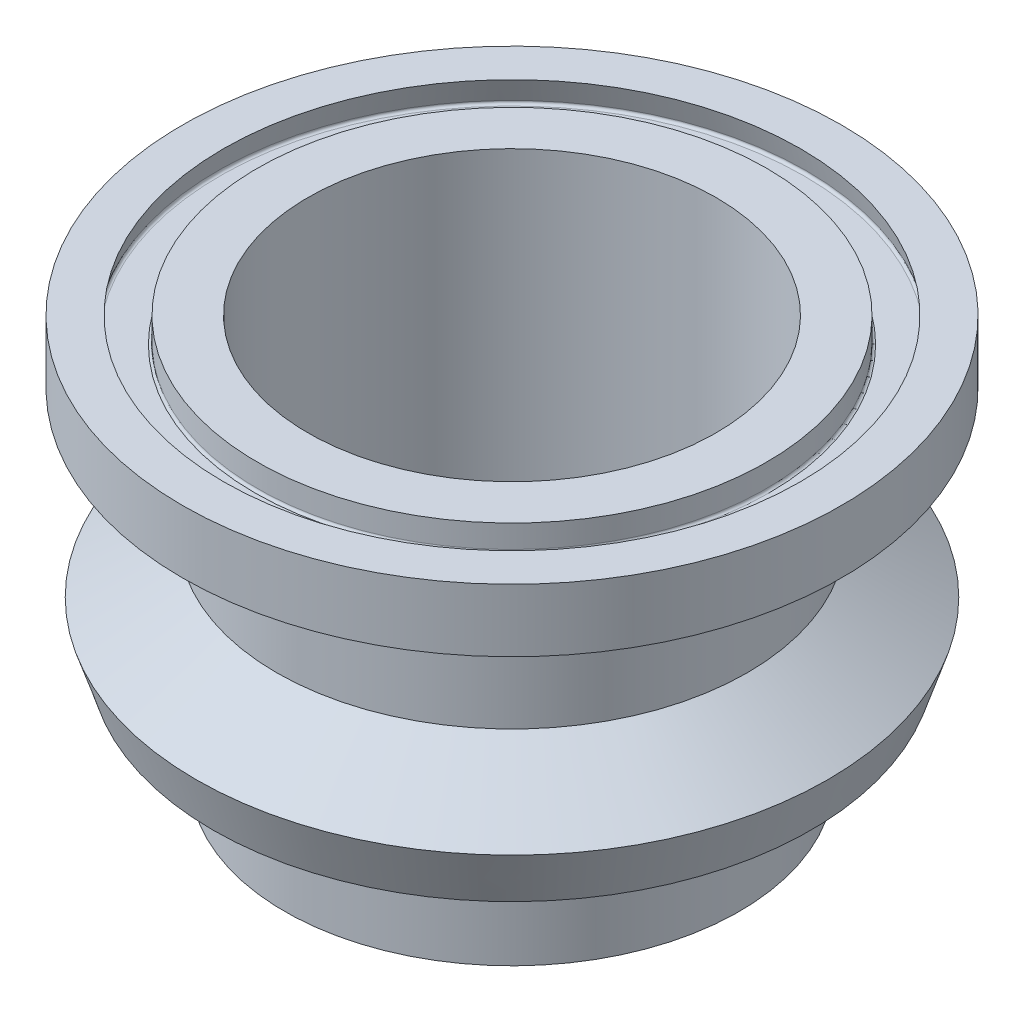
ISO-10303-21;
HEADER;
FILE_DESCRIPTION(('STEP AP214'),'2;1');
FILE_NAME('part.step','',(''),(''),'','','');
FILE_SCHEMA(('AUTOMOTIVE_DESIGN { 1 0 10303 214 1 1 1 1 }'));
ENDSEC;
DATA;
#1=APPLICATION_CONTEXT('core data for automotive mechanical design processes');
#2=APPLICATION_PROTOCOL_DEFINITION('international standard','automotive_design',2000,#1);
#3=PRODUCT_CONTEXT('',#1,'mechanical');
#4=PRODUCT('Part','Part','',(#3));
#5=PRODUCT_RELATED_PRODUCT_CATEGORY('part','',(#4));
#6=PRODUCT_DEFINITION_FORMATION('','',#4);
#7=PRODUCT_DEFINITION_CONTEXT('part definition',#1,'design');
#8=PRODUCT_DEFINITION('design','',#6,#7);
#9=PRODUCT_DEFINITION_SHAPE('','',#8);
#10=(LENGTH_UNIT() NAMED_UNIT(*) SI_UNIT(.MILLI.,.METRE.));
#11=(NAMED_UNIT(*) PLANE_ANGLE_UNIT() SI_UNIT($,.RADIAN.));
#12=(NAMED_UNIT(*) SI_UNIT($,.STERADIAN.) SOLID_ANGLE_UNIT());
#13=UNCERTAINTY_MEASURE_WITH_UNIT(LENGTH_MEASURE(1.E-05),#10,'distance_accuracy_value','');
#14=(GEOMETRIC_REPRESENTATION_CONTEXT(3) GLOBAL_UNCERTAINTY_ASSIGNED_CONTEXT((#13)) GLOBAL_UNIT_ASSIGNED_CONTEXT((#10,
#11,#12)) REPRESENTATION_CONTEXT('',''));
#15=CARTESIAN_POINT('',(0.,0.,0.));
#16=DIRECTION('',(0.,0.,1.));
#17=DIRECTION('',(1.,0.,0.));
#18=AXIS2_PLACEMENT_3D('',#15,#16,#17);
#19=CARTESIAN_POINT('',(33.3375,127.,0.));
#20=DIRECTION('',(0.,1.,0.));
#21=DIRECTION('',(0.,0.,1.));
#22=AXIS2_PLACEMENT_3D('',#19,#20,#21);
#23=PLANE('',#22);
#24=CARTESIAN_POINT('',(0.,127.,0.));
#25=DIRECTION('',(0.,-1.,0.));
#26=DIRECTION('',(0.,0.,-1.));
#27=AXIS2_PLACEMENT_3D('',#24,#25,#26);
#28=CIRCLE('',#27,29.1830031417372);
#29=CARTESIAN_POINT('',(0.,127.,-29.1830031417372));
#30=VERTEX_POINT('',#29);
#31=EDGE_CURVE('E103',#30,#30,#28,.T.);
#32=ORIENTED_EDGE('',*,*,#31,.T.);
#33=EDGE_LOOP('',(#32));
#34=FACE_BOUND('',#33,.T.);
#35=CARTESIAN_POINT('',(0.,127.,0.));
#36=DIRECTION('',(0.,-1.,0.));
#37=DIRECTION('',(0.,0.,-1.));
#38=AXIS2_PLACEMENT_3D('',#35,#36,#37);
#39=CIRCLE('',#38,33.3375);
#40=CARTESIAN_POINT('',(0.,127.,-33.3375));
#41=VERTEX_POINT('',#40);
#42=EDGE_CURVE('E10',#41,#41,#39,.T.);
#43=ORIENTED_EDGE('',*,*,#42,.F.);
#44=EDGE_LOOP('',(#43));
#45=FACE_BOUND('',#44,.T.);
#46=ADVANCED_FACE('F33',(#34,#45),#23,.T.);
#47=CARTESIAN_POINT('',(0.,0.,0.));
#48=DIRECTION('',(0.,-1.,0.));
#49=DIRECTION('',(0.,0.,-1.));
#50=AXIS2_PLACEMENT_3D('',#47,#48,#49);
#51=CYLINDRICAL_SURFACE('',#50,33.3375);
#52=ORIENTED_EDGE('',*,*,#42,.T.);
#53=EDGE_LOOP('',(#52));
#54=FACE_BOUND('',#53,.T.);
#55=CARTESIAN_POINT('',(0.,120.65,0.));
#56=DIRECTION('',(0.,-1.,0.));
#57=DIRECTION('',(0.,0.,-1.));
#58=AXIS2_PLACEMENT_3D('',#55,#56,#57);
#59=CIRCLE('',#58,33.3375);
#60=CARTESIAN_POINT('',(0.,120.65,-33.3375));
#61=VERTEX_POINT('',#60);
#62=EDGE_CURVE('E39',#61,#61,#59,.T.);
#63=ORIENTED_EDGE('',*,*,#62,.F.);
#64=EDGE_LOOP('',(#63));
#65=FACE_BOUND('',#64,.T.);
#66=ADVANCED_FACE('F121',(#54,#65),#51,.T.);
#67=CARTESIAN_POINT('',(33.3375,120.65,0.));
#68=DIRECTION('',(0.,-1.,0.));
#69=DIRECTION('',(0.,0.,-1.));
#70=AXIS2_PLACEMENT_3D('',#67,#68,#69);
#71=PLANE('',#70);
#72=ORIENTED_EDGE('',*,*,#62,.T.);
#73=EDGE_LOOP('',(#72));
#74=FACE_BOUND('',#73,.T.);
#75=CARTESIAN_POINT('',(0.,120.65,0.));
#76=DIRECTION('',(0.,-1.,0.));
#77=DIRECTION('',(0.,0.,-1.));
#78=AXIS2_PLACEMENT_3D('',#75,#76,#77);
#79=CIRCLE('',#78,23.8125);
#80=CARTESIAN_POINT('',(0.,120.65,-23.8125));
#81=VERTEX_POINT('',#80);
#82=EDGE_CURVE('E43',#81,#81,#79,.T.);
#83=ORIENTED_EDGE('',*,*,#82,.F.);
#84=EDGE_LOOP('',(#83));
#85=FACE_BOUND('',#84,.T.);
#86=ADVANCED_FACE('F125',(#74,#85),#71,.T.);
#87=CARTESIAN_POINT('',(0.,0.,0.));
#88=DIRECTION('',(0.,-1.,0.));
#89=DIRECTION('',(0.,0.,-1.));
#90=AXIS2_PLACEMENT_3D('',#87,#88,#89);
#91=CYLINDRICAL_SURFACE('',#90,23.8125);
#92=ORIENTED_EDGE('',*,*,#82,.T.);
#93=EDGE_LOOP('',(#92));
#94=FACE_BOUND('',#93,.T.);
#95=CARTESIAN_POINT('',(0.,107.583074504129,0.));
#96=DIRECTION('',(0.,-1.,0.));
#97=DIRECTION('',(0.,0.,-1.));
#98=AXIS2_PLACEMENT_3D('',#95,#96,#97);
#99=CIRCLE('',#98,23.8125);
#100=CARTESIAN_POINT('',(0.,107.583074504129,-23.8125));
#101=VERTEX_POINT('',#100);
#102=EDGE_CURVE('E47',#101,#101,#99,.T.);
#103=ORIENTED_EDGE('',*,*,#102,.F.);
#104=EDGE_LOOP('',(#103));
#105=FACE_BOUND('',#104,.T.);
#106=ADVANCED_FACE('F129',(#94,#105),#91,.T.);
#107=CARTESIAN_POINT('',(0.,102.292581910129,0.));
#108=DIRECTION('',(0.,-1.,0.));
#109=DIRECTION('',(0.,0.,-1.));
#110=AXIS2_PLACEMENT_3D('',#107,#108,#109);
#111=CONICAL_SURFACE('',#110,31.9591441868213,0.994837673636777);
#112=ORIENTED_EDGE('',*,*,#102,.T.);
#113=EDGE_LOOP('',(#112));
#114=FACE_BOUND('',#113,.T.);
#115=CARTESIAN_POINT('',(0.,102.292581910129,0.));
#116=DIRECTION('',(0.,-1.,0.));
#117=DIRECTION('',(0.,0.,-1.));
#118=AXIS2_PLACEMENT_3D('',#115,#116,#117);
#119=CIRCLE('',#118,31.9591441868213);
#120=CARTESIAN_POINT('',(0.,102.292581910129,-31.9591441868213));
#121=VERTEX_POINT('',#120);
#122=EDGE_CURVE('E52',#121,#121,#119,.T.);
#123=ORIENTED_EDGE('',*,*,#122,.F.);
#124=EDGE_LOOP('',(#123));
#125=FACE_BOUND('',#124,.T.);
#126=ADVANCED_FACE('F135',(#114,#125),#111,.T.);
#127=CARTESIAN_POINT('',(0.,97.0077414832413,0.));
#128=DIRECTION('',(0.,1.,0.));
#129=DIRECTION('',(0.,0.,1.));
#130=AXIS2_PLACEMENT_3D('',#127,#128,#129);
#131=CONICAL_SURFACE('',#130,30.2419954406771,0.314159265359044);
#132=ORIENTED_EDGE('',*,*,#122,.T.);
#133=EDGE_LOOP('',(#132));
#134=FACE_BOUND('',#133,.T.);
#135=CARTESIAN_POINT('',(0.,97.0077414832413,0.));
#136=DIRECTION('',(0.,-1.,0.));
#137=DIRECTION('',(0.,0.,-1.));
#138=AXIS2_PLACEMENT_3D('',#135,#136,#137);
#139=CIRCLE('',#138,30.2419954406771);
#140=CARTESIAN_POINT('',(0.,97.0077414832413,-30.2419954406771));
#141=VERTEX_POINT('',#140);
#142=EDGE_CURVE('E55',#141,#141,#139,.T.);
#143=ORIENTED_EDGE('',*,*,#142,.F.);
#144=EDGE_LOOP('',(#143));
#145=FACE_BOUND('',#144,.T.);
#146=ADVANCED_FACE('F139',(#134,#145),#131,.T.);
#147=CARTESIAN_POINT('',(0.,97.4541643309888,0.));
#148=DIRECTION('',(0.,-1.,0.));
#149=DIRECTION('',(0.,0.,-1.));
#150=AXIS2_PLACEMENT_3D('',#147,#148,#149);
#151=CONICAL_SURFACE('',#150,28.8849875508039,1.25297260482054);
#152=ORIENTED_EDGE('',*,*,#142,.T.);
#153=EDGE_LOOP('',(#152));
#154=FACE_BOUND('',#153,.T.);
#155=CARTESIAN_POINT('',(0.,97.4541643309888,0.));
#156=DIRECTION('',(0.,-1.,0.));
#157=DIRECTION('',(0.,0.,-1.));
#158=AXIS2_PLACEMENT_3D('',#155,#156,#157);
#159=CIRCLE('',#158,28.8849875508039);
#160=CARTESIAN_POINT('',(0.,97.4541643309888,-28.8849875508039));
#161=VERTEX_POINT('',#160);
#162=EDGE_CURVE('E58',#161,#161,#159,.T.);
#163=ORIENTED_EDGE('',*,*,#162,.F.);
#164=EDGE_LOOP('',(#163));
#165=FACE_BOUND('',#164,.T.);
#166=ADVANCED_FACE('F143',(#154,#165),#151,.F.);
#167=CARTESIAN_POINT('',(0.,99.4877328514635,0.));
#168=DIRECTION('',(0.,1.,0.));
#169=DIRECTION('',(0.,0.,1.));
#170=AXIS2_PLACEMENT_3D('',#167,#168,#169);
#171=CONICAL_SURFACE('',#170,30.0590688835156,0.523598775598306);
#172=ORIENTED_EDGE('',*,*,#162,.T.);
#173=EDGE_LOOP('',(#172));
#174=FACE_BOUND('',#173,.T.);
#175=CARTESIAN_POINT('',(0.,99.4877328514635,0.));
#176=DIRECTION('',(0.,-1.,0.));
#177=DIRECTION('',(0.,0.,-1.));
#178=AXIS2_PLACEMENT_3D('',#175,#176,#177);
#179=CIRCLE('',#178,30.0590688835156);
#180=CARTESIAN_POINT('',(0.,99.4877328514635,-30.0590688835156));
#181=VERTEX_POINT('',#180);
#182=EDGE_CURVE('E61',#181,#181,#179,.T.);
#183=ORIENTED_EDGE('',*,*,#182,.F.);
#184=EDGE_LOOP('',(#183));
#185=FACE_BOUND('',#184,.T.);
#186=ADVANCED_FACE('F147',(#174,#185),#171,.F.);
#187=CARTESIAN_POINT('',(0.,99.6147328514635,0.));
#188=DIRECTION('',(0.,-1.,0.));
#189=DIRECTION('',(0.,0.,-1.));
#190=AXIS2_PLACEMENT_3D('',#187,#188,#189);
#191=TOROIDAL_SURFACE('',#190,29.8390984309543,0.253999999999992);
#192=ORIENTED_EDGE('',*,*,#182,.T.);
#193=EDGE_LOOP('',(#192));
#194=FACE_BOUND('',#193,.T.);
#195=CARTESIAN_POINT('',(0.,99.8600780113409,0.));
#196=DIRECTION('',(0.,-1.,0.));
#197=DIRECTION('',(0.,0.,-1.));
#198=AXIS2_PLACEMENT_3D('',#195,#196,#197);
#199=CIRCLE('',#198,29.9048384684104);
#200=CARTESIAN_POINT('',(0.,99.8600780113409,-29.9048384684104));
#201=VERTEX_POINT('',#200);
#202=EDGE_CURVE('E64',#201,#201,#199,.T.);
#203=ORIENTED_EDGE('',*,*,#202,.F.);
#204=EDGE_LOOP('',(#203));
#205=FACE_BOUND('',#204,.T.);
#206=ADVANCED_FACE('F151',(#194,#205),#191,.F.);
#207=CARTESIAN_POINT('',(0.,100.773652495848,0.));
#208=DIRECTION('',(0.,-1.,0.));
#209=DIRECTION('',(0.,0.,-1.));
#210=AXIS2_PLACEMENT_3D('',#207,#208,#209);
#211=CONICAL_SURFACE('',#210,26.4953320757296,1.30899693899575);
#212=ORIENTED_EDGE('',*,*,#202,.T.);
#213=EDGE_LOOP('',(#212));
#214=FACE_BOUND('',#213,.T.);
#215=CARTESIAN_POINT('',(0.,100.773652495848,0.));
#216=DIRECTION('',(0.,-1.,0.));
#217=DIRECTION('',(0.,0.,-1.));
#218=AXIS2_PLACEMENT_3D('',#215,#216,#217);
#219=CIRCLE('',#218,26.4953320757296);
#220=CARTESIAN_POINT('',(0.,100.773652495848,-26.4953320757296));
#221=VERTEX_POINT('',#220);
#222=EDGE_CURVE('E67',#221,#221,#219,.T.);
#223=ORIENTED_EDGE('',*,*,#222,.F.);
#224=EDGE_LOOP('',(#223));
#225=FACE_BOUND('',#224,.T.);
#226=ADVANCED_FACE('F155',(#214,#225),#211,.F.);
#227=CARTESIAN_POINT('',(0.,100.528307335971,0.));
#228=DIRECTION('',(0.,-1.,0.));
#229=DIRECTION('',(0.,0.,-1.));
#230=AXIS2_PLACEMENT_3D('',#227,#228,#229);
#231=TOROIDAL_SURFACE('',#230,26.4295920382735,0.253999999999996);
#232=ORIENTED_EDGE('',*,*,#222,.T.);
#233=EDGE_LOOP('',(#232));
#234=FACE_BOUND('',#233,.T.);
#235=CARTESIAN_POINT('',(0.,100.594047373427,0.));
#236=DIRECTION('',(0.,-1.,0.));
#237=DIRECTION('',(0.,0.,-1.));
#238=AXIS2_PLACEMENT_3D('',#235,#236,#237);
#239=CIRCLE('',#238,26.1842468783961);
#240=CARTESIAN_POINT('',(0.,100.594047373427,-26.1842468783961));
#241=VERTEX_POINT('',#240);
#242=EDGE_CURVE('E70',#241,#241,#239,.T.);
#243=ORIENTED_EDGE('',*,*,#242,.F.);
#244=EDGE_LOOP('',(#243));
#245=FACE_BOUND('',#244,.T.);
#246=ADVANCED_FACE('F159',(#234,#245),#231,.F.);
#247=CARTESIAN_POINT('',(0.,98.3614064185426,0.));
#248=DIRECTION('',(0.,1.,0.));
#249=DIRECTION('',(0.,0.,1.));
#250=AXIS2_PLACEMENT_3D('',#247,#248,#249);
#251=CONICAL_SURFACE('',#250,25.5860125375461,0.261799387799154);
#252=ORIENTED_EDGE('',*,*,#242,.T.);
#253=EDGE_LOOP('',(#252));
#254=FACE_BOUND('',#253,.T.);
#255=CARTESIAN_POINT('',(0.,98.3614064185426,0.));
#256=DIRECTION('',(0.,-1.,0.));
#257=DIRECTION('',(0.,0.,-1.));
#258=AXIS2_PLACEMENT_3D('',#255,#256,#257);
#259=CIRCLE('',#258,25.5860125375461);
#260=CARTESIAN_POINT('',(0.,98.3614064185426,-25.5860125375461));
#261=VERTEX_POINT('',#260);
#262=EDGE_CURVE('E73',#261,#261,#259,.T.);
#263=ORIENTED_EDGE('',*,*,#262,.F.);
#264=EDGE_LOOP('',(#263));
#265=FACE_BOUND('',#264,.T.);
#266=ADVANCED_FACE('F163',(#254,#265),#251,.T.);
#267=CARTESIAN_POINT('',(0.,98.9624868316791,0.));
#268=DIRECTION('',(0.,-1.,0.));
#269=DIRECTION('',(0.,0.,-1.));
#270=AXIS2_PLACEMENT_3D('',#267,#268,#269);
#271=CONICAL_SURFACE('',#270,22.9997,1.34244187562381);
#272=ORIENTED_EDGE('',*,*,#262,.T.);
#273=EDGE_LOOP('',(#272));
#274=FACE_BOUND('',#273,.T.);
#275=CARTESIAN_POINT('',(0.,98.9624868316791,0.));
#276=DIRECTION('',(0.,-1.,0.));
#277=DIRECTION('',(0.,0.,-1.));
#278=AXIS2_PLACEMENT_3D('',#275,#276,#277);
#279=CIRCLE('',#278,22.9997);
#280=CARTESIAN_POINT('',(0.,98.9624868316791,-22.9997));
#281=VERTEX_POINT('',#280);
#282=EDGE_CURVE('E76',#281,#281,#279,.T.);
#283=ORIENTED_EDGE('',*,*,#282,.F.);
#284=EDGE_LOOP('',(#283));
#285=FACE_BOUND('',#284,.T.);
#286=ADVANCED_FACE('F167',(#274,#285),#271,.F.);
#287=CARTESIAN_POINT('',(0.,0.,0.));
#288=DIRECTION('',(0.,-1.,0.));
#289=DIRECTION('',(0.,0.,-1.));
#290=AXIS2_PLACEMENT_3D('',#287,#288,#289);
#291=CYLINDRICAL_SURFACE('',#290,22.9997);
#292=ORIENTED_EDGE('',*,*,#282,.T.);
#293=EDGE_LOOP('',(#292));
#294=FACE_BOUND('',#293,.T.);
#295=CARTESIAN_POINT('',(0.,86.2624868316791,0.));
#296=DIRECTION('',(0.,-1.,0.));
#297=DIRECTION('',(0.,0.,-1.));
#298=AXIS2_PLACEMENT_3D('',#295,#296,#297);
#299=CIRCLE('',#298,22.9997);
#300=CARTESIAN_POINT('',(0.,86.2624868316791,-22.9997));
#301=VERTEX_POINT('',#300);
#302=EDGE_CURVE('E79',#301,#301,#299,.T.);
#303=ORIENTED_EDGE('',*,*,#302,.F.);
#304=EDGE_LOOP('',(#303));
#305=FACE_BOUND('',#304,.T.);
#306=ADVANCED_FACE('F171',(#294,#305),#291,.T.);
#307=CARTESIAN_POINT('',(22.9997,86.2624868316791,0.));
#308=DIRECTION('',(0.,-1.,0.));
#309=DIRECTION('',(0.,0.,-1.));
#310=AXIS2_PLACEMENT_3D('',#307,#308,#309);
#311=PLANE('',#310);
#312=ORIENTED_EDGE('',*,*,#302,.T.);
#313=EDGE_LOOP('',(#312));
#314=FACE_BOUND('',#313,.T.);
#315=CARTESIAN_POINT('',(0.,86.2624868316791,0.));
#316=DIRECTION('',(0.,-1.,0.));
#317=DIRECTION('',(0.,0.,-1.));
#318=AXIS2_PLACEMENT_3D('',#315,#316,#317);
#319=CIRCLE('',#318,20.6375);
#320=CARTESIAN_POINT('',(0.,86.2624868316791,-20.6375));
#321=VERTEX_POINT('',#320);
#322=EDGE_CURVE('E82',#321,#321,#319,.T.);
#323=ORIENTED_EDGE('',*,*,#322,.F.);
#324=EDGE_LOOP('',(#323));
#325=FACE_BOUND('',#324,.T.);
#326=ADVANCED_FACE('F175',(#314,#325),#311,.T.);
#327=CARTESIAN_POINT('',(0.,0.,0.));
#328=DIRECTION('',(0.,-1.,0.));
#329=DIRECTION('',(0.,0.,-1.));
#330=AXIS2_PLACEMENT_3D('',#327,#328,#329);
#331=CYLINDRICAL_SURFACE('',#330,20.6375);
#332=ORIENTED_EDGE('',*,*,#322,.T.);
#333=EDGE_LOOP('',(#332));
#334=FACE_BOUND('',#333,.T.);
#335=CARTESIAN_POINT('',(0.,127.,0.));
#336=DIRECTION('',(0.,-1.,0.));
#337=DIRECTION('',(0.,0.,-1.));
#338=AXIS2_PLACEMENT_3D('',#335,#336,#337);
#339=CIRCLE('',#338,20.6375);
#340=CARTESIAN_POINT('',(0.,127.,-20.6375));
#341=VERTEX_POINT('',#340);
#342=EDGE_CURVE('E85',#341,#341,#339,.T.);
#343=ORIENTED_EDGE('',*,*,#342,.F.);
#344=EDGE_LOOP('',(#343));
#345=FACE_BOUND('',#344,.T.);
#346=ADVANCED_FACE('F179',(#334,#345),#331,.F.);
#347=CARTESIAN_POINT('',(25.7556,127.,0.));
#348=DIRECTION('',(0.,1.,0.));
#349=DIRECTION('',(0.,0.,1.));
#350=AXIS2_PLACEMENT_3D('',#347,#348,#349);
#351=PLANE('',#350);
#352=ORIENTED_EDGE('',*,*,#342,.T.);
#353=EDGE_LOOP('',(#352));
#354=FACE_BOUND('',#353,.T.);
#355=CARTESIAN_POINT('',(0.,127.,0.));
#356=DIRECTION('',(0.,-1.,0.));
#357=DIRECTION('',(0.,0.,-1.));
#358=AXIS2_PLACEMENT_3D('',#355,#356,#357);
#359=CIRCLE('',#358,25.7556);
#360=CARTESIAN_POINT('',(0.,127.,-25.7556));
#361=VERTEX_POINT('',#360);
#362=EDGE_CURVE('E88',#361,#361,#359,.T.);
#363=ORIENTED_EDGE('',*,*,#362,.F.);
#364=EDGE_LOOP('',(#363));
#365=FACE_BOUND('',#364,.T.);
#366=ADVANCED_FACE('F183',(#354,#365),#351,.T.);
#367=CARTESIAN_POINT('',(0.,0.,0.));
#368=DIRECTION('',(0.,-1.,0.));
#369=DIRECTION('',(0.,0.,-1.));
#370=AXIS2_PLACEMENT_3D('',#367,#368,#369);
#371=CYLINDRICAL_SURFACE('',#370,25.7556);
#372=ORIENTED_EDGE('',*,*,#362,.T.);
#373=EDGE_LOOP('',(#372));
#374=FACE_BOUND('',#373,.T.);
#375=CARTESIAN_POINT('',(0.,124.6886,0.));
#376=DIRECTION('',(0.,-1.,0.));
#377=DIRECTION('',(0.,0.,-1.));
#378=AXIS2_PLACEMENT_3D('',#375,#376,#377);
#379=CIRCLE('',#378,25.7556);
#380=CARTESIAN_POINT('',(0.,124.6886,-25.7556));
#381=VERTEX_POINT('',#380);
#382=EDGE_CURVE('E91',#381,#381,#379,.T.);
#383=ORIENTED_EDGE('',*,*,#382,.F.);
#384=EDGE_LOOP('',(#383));
#385=FACE_BOUND('',#384,.T.);
#386=ADVANCED_FACE('F187',(#374,#385),#371,.T.);
#387=CARTESIAN_POINT('',(0.,124.6886,0.));
#388=DIRECTION('',(0.,-1.,0.));
#389=DIRECTION('',(0.,0.,-1.));
#390=AXIS2_PLACEMENT_3D('',#387,#388,#389);
#391=TOROIDAL_SURFACE('',#390,26.0096,0.254000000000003);
#392=ORIENTED_EDGE('',*,*,#382,.T.);
#393=EDGE_LOOP('',(#392));
#394=FACE_BOUND('',#393,.T.);
#395=CARTESIAN_POINT('',(0.,124.4346,0.));
#396=DIRECTION('',(0.,-1.,0.));
#397=DIRECTION('',(0.,0.,-1.));
#398=AXIS2_PLACEMENT_3D('',#395,#396,#397);
#399=CIRCLE('',#398,26.0096);
#400=CARTESIAN_POINT('',(0.,124.4346,-26.0096));
#401=VERTEX_POINT('',#400);
#402=EDGE_CURVE('E94',#401,#401,#399,.T.);
#403=ORIENTED_EDGE('',*,*,#402,.F.);
#404=EDGE_LOOP('',(#403));
#405=FACE_BOUND('',#404,.T.);
#406=ADVANCED_FACE('F191',(#394,#405),#391,.F.);
#407=CARTESIAN_POINT('',(29.5393807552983,124.4346,0.));
#408=DIRECTION('',(0.,1.,0.));
#409=DIRECTION('',(0.,0.,1.));
#410=AXIS2_PLACEMENT_3D('',#407,#408,#409);
#411=PLANE('',#410);
#412=ORIENTED_EDGE('',*,*,#402,.T.);
#413=EDGE_LOOP('',(#412));
#414=FACE_BOUND('',#413,.T.);
#415=CARTESIAN_POINT('',(0.,124.4346,0.));
#416=DIRECTION('',(0.,-1.,0.));
#417=DIRECTION('',(0.,0.,-1.));
#418=AXIS2_PLACEMENT_3D('',#415,#416,#417);
#419=CIRCLE('',#418,29.5393807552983);
#420=CARTESIAN_POINT('',(0.,124.4346,-29.5393807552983));
#421=VERTEX_POINT('',#420);
#422=EDGE_CURVE('E97',#421,#421,#419,.T.);
#423=ORIENTED_EDGE('',*,*,#422,.F.);
#424=EDGE_LOOP('',(#423));
#425=FACE_BOUND('',#424,.T.);
#426=ADVANCED_FACE('F117',(#414,#425),#411,.T.);
#427=CARTESIAN_POINT('',(0.,124.6886,0.));
#428=DIRECTION('',(0.,-1.,0.));
#429=DIRECTION('',(0.,0.,-1.));
#430=AXIS2_PLACEMENT_3D('',#427,#428,#429);
#431=TOROIDAL_SURFACE('',#430,29.5393807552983,0.254000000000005);
#432=ORIENTED_EDGE('',*,*,#422,.T.);
#433=EDGE_LOOP('',(#432));
#434=FACE_BOUND('',#433,.T.);
#435=CARTESIAN_POINT('',(0.,124.754340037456,0.));
#436=DIRECTION('',(0.,-1.,0.));
#437=DIRECTION('',(0.,0.,-1.));
#438=AXIS2_PLACEMENT_3D('',#435,#436,#437);
#439=CIRCLE('',#438,29.7847259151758);
#440=CARTESIAN_POINT('',(0.,124.754340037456,-29.7847259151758));
#441=VERTEX_POINT('',#440);
#442=EDGE_CURVE('E100',#441,#441,#439,.T.);
#443=ORIENTED_EDGE('',*,*,#442,.F.);
#444=EDGE_LOOP('',(#443));
#445=FACE_BOUND('',#444,.T.);
#446=ADVANCED_FACE('F111',(#434,#445),#431,.F.);
#447=CARTESIAN_POINT('',(0.,127.,0.));
#448=DIRECTION('',(0.,-1.,0.));
#449=DIRECTION('',(0.,0.,-1.));
#450=AXIS2_PLACEMENT_3D('',#447,#448,#449);
#451=CONICAL_SURFACE('',#450,29.1830031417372,0.261799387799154);
#452=ORIENTED_EDGE('',*,*,#442,.T.);
#453=EDGE_LOOP('',(#452));
#454=FACE_BOUND('',#453,.T.);
#455=ORIENTED_EDGE('',*,*,#31,.F.);
#456=EDGE_LOOP('',(#455));
#457=FACE_BOUND('',#456,.T.);
#458=ADVANCED_FACE('F109',(#454,#457),#451,.F.);
#459=CLOSED_SHELL('',(#46,#66,#86,#106,#126,#146,#166,#186,#206,#226,#246,#266,#286,#306,#326,
#346,#366,#386,#406,#426,#446,#458));
#460=MANIFOLD_SOLID_BREP('B2',#459);
#461=ADVANCED_BREP_SHAPE_REPRESENTATION('',(#18,#460),#14);
#462=SHAPE_DEFINITION_REPRESENTATION(#9,#461);
ENDSEC;
END-ISO-10303-21;
